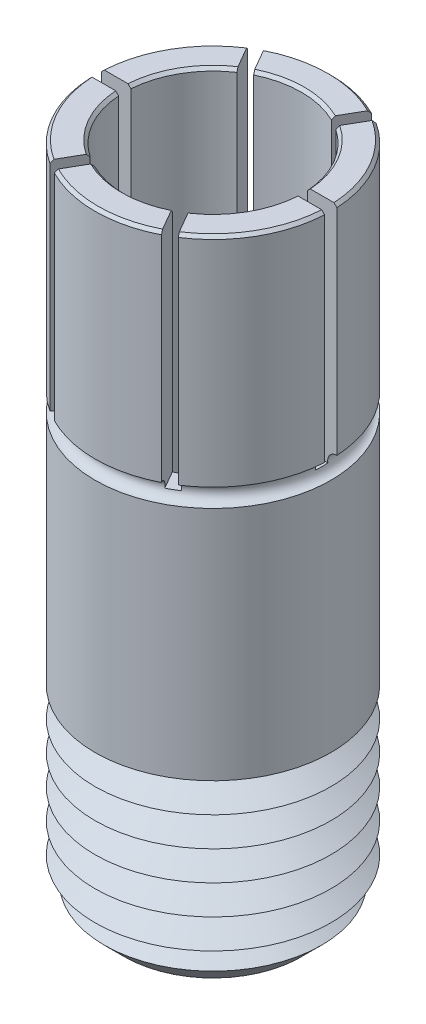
from build123d import *

# Parameters (mm, degrees)
CHAMFER1_SIZE       = 0.2
CUT_EXTRUDE1_DEPTH  = 15.5
CIRPATTERN1_COUNT   = 6
SKETCH8_R           = 8
BOSS_EXTRUDE1_DEPTH = 13
CHAMFER2_SIZE       = 2
LPATTERN1_COUNT     = 7
LPATTERN1_PITCH     = 2


with BuildPart() as part:
    # Sketch2 → Revolve1 (revolve)
    with BuildSketch(Plane(origin=(0, 0, 0), x_dir=(0, 0, -1), z_dir=(1, 0, 0))):
        with BuildLine():
            Line((-6, 6.825306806), (-6, -25.174693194))
            Line((-6, -25.174693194), (-8, -25.174693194))
            Line((-8, -25.174693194), (-8, -9.174693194))
            ThreePointArc((-8, -9.174693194), (-7.375, -8.549693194), (-8, -7.924693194))
            Line((-8, -7.924693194), (-8, 6.825306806))
            Line((-8, 6.825306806), (-6, 6.825306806))
        make_face()
    revolve(axis=Axis((0, 63.031918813, 0), (0, -1, 0)))

    # Chamfer1
    chamfer1_edges = [part.edges().sort_by_distance(p)[0] for p in [
        (0, 6.825306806, -6),
        (0, 6.825306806, -8),
    ]]
    chamfer(chamfer1_edges, length=CHAMFER1_SIZE)

    # Sketch5 → Cut-Extrude1 (cut)
    with BuildSketch(Plane(origin=(0, 6.825306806, 0), x_dir=(1, 0, 0), z_dir=(0, 1, 0))):
        with BuildLine():
            Line((-4.982608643, -0.416666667), (-7.989141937, -0.416666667))
            ThreePointArc((-7.989141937, -0.416666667), (-8, 0), (-7.989141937, 0.416666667))
            Line((-7.989141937, 0.416666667), (-4.982608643, 0.416666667))
            ThreePointArc((-4.982608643, 0.416666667), (-5, 0), (-4.982608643, -0.416666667))
        make_face()
    cut_extrude1 = extrude(amount=-CUT_EXTRUDE1_DEPTH, mode=Mode.SUBTRACT)

    # CirPattern1: Cut-Extrude1 ×6 about axis
    cirpattern1_axis = Axis((0, 0, 0), (0, 1, 0))
    for i in range(1, CIRPATTERN1_COUNT):
        add(cut_extrude1.rotate(cirpattern1_axis, i * 360 / CIRPATTERN1_COUNT), mode=Mode.SUBTRACT)

    # Sketch8 → Boss-Extrude1 (add)
    with BuildSketch(Plane.XZ.offset(25.174693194)):
        with Locations(Location((0, 0, 0), (0, 0, 90))):
            Circle(SKETCH8_R)
    extrude(amount=BOSS_EXTRUDE1_DEPTH)

    # Chamfer2
    chamfer2_edges = [part.edges().sort_by_distance(p)[0] for p in [
        (0, -38.174693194, -8),
    ]]
    chamfer(chamfer2_edges, length=CHAMFER2_SIZE)

    # Sketch10 → Cut-Revolve1 (revolve, cut)
    with BuildSketch(Plane(origin=(0, 0, 0), x_dir=(0, 0, -1), z_dir=(1, 0, 0)), mode=Mode.PRIVATE) as cut_revolve1_sk:
        Polygon((8, -25.174693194), (6.267949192, -26.174693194), (8, -27.174693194), align=None)
    cut_revolve1 = revolve(cut_revolve1_sk.sketch.rotate(Axis((0, 63.031918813, 0), (0, -1, 0)), 180), axis=Axis((0, 63.031918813, 0), (0, -1, 0)), mode=Mode.SUBTRACT)

    # LPattern1: Cut-Revolve1 ×7
    with Locations(*[(0, -i * LPATTERN1_PITCH, 0) for i in range(1, LPATTERN1_COUNT)]):
        add(cut_revolve1, mode=Mode.SUBTRACT)


solid = part.part
